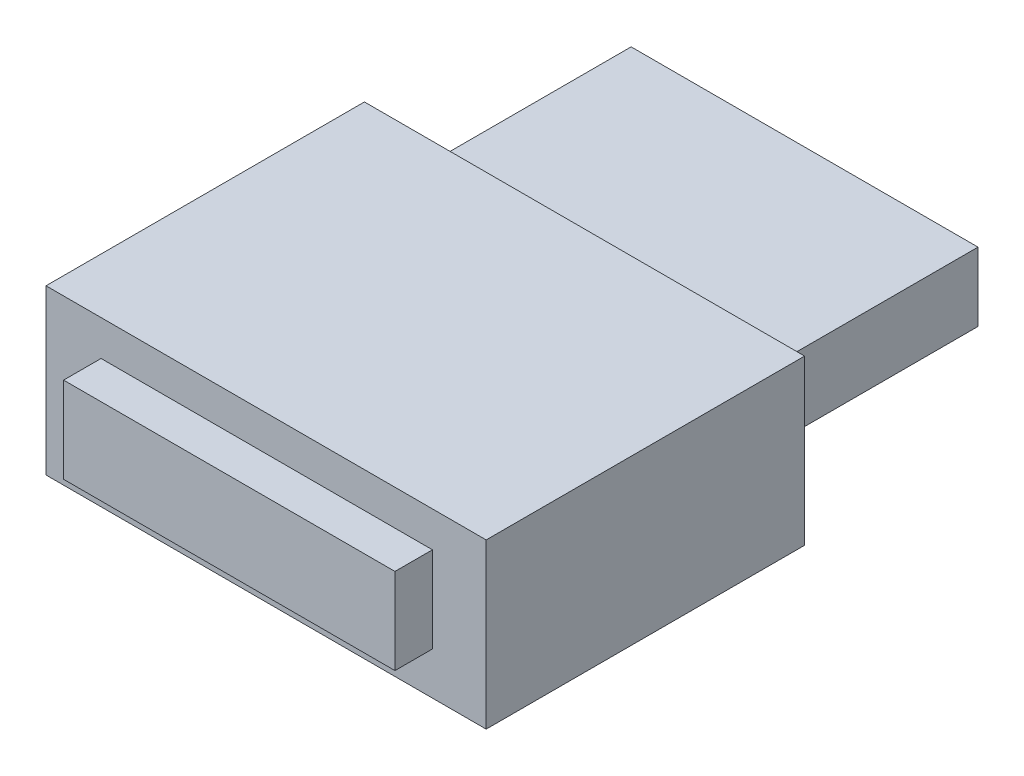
ISO-10303-21;
HEADER;
FILE_DESCRIPTION(('STEP AP214'),'2;1');
FILE_NAME('part.step','',(''),(''),'','','');
FILE_SCHEMA(('AUTOMOTIVE_DESIGN { 1 0 10303 214 1 1 1 1 }'));
ENDSEC;
DATA;
#1=APPLICATION_CONTEXT('core data for automotive mechanical design processes');
#2=APPLICATION_PROTOCOL_DEFINITION('international standard','automotive_design',2000,#1);
#3=PRODUCT_CONTEXT('',#1,'mechanical');
#4=PRODUCT('Part','Part','',(#3));
#5=PRODUCT_RELATED_PRODUCT_CATEGORY('part','',(#4));
#6=PRODUCT_DEFINITION_FORMATION('','',#4);
#7=PRODUCT_DEFINITION_CONTEXT('part definition',#1,'design');
#8=PRODUCT_DEFINITION('design','',#6,#7);
#9=PRODUCT_DEFINITION_SHAPE('','',#8);
#10=(LENGTH_UNIT() NAMED_UNIT(*) SI_UNIT(.MILLI.,.METRE.));
#11=(NAMED_UNIT(*) PLANE_ANGLE_UNIT() SI_UNIT($,.RADIAN.));
#12=(NAMED_UNIT(*) SI_UNIT($,.STERADIAN.) SOLID_ANGLE_UNIT());
#13=UNCERTAINTY_MEASURE_WITH_UNIT(LENGTH_MEASURE(1.E-05),#10,'distance_accuracy_value','');
#14=(GEOMETRIC_REPRESENTATION_CONTEXT(3) GLOBAL_UNCERTAINTY_ASSIGNED_CONTEXT((#13)) GLOBAL_UNIT_ASSIGNED_CONTEXT((#10,
#11,#12)) REPRESENTATION_CONTEXT('',''));
#15=CARTESIAN_POINT('',(0.,0.,0.));
#16=DIRECTION('',(0.,0.,1.));
#17=DIRECTION('',(1.,0.,0.));
#18=AXIS2_PLACEMENT_3D('',#15,#16,#17);
#19=CARTESIAN_POINT('',(-71.6746354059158,35.56,-29.6601759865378));
#20=DIRECTION('',(0.,0.,1.));
#21=DIRECTION('',(1.,0.,0.));
#22=AXIS2_PLACEMENT_3D('',#19,#20,#21);
#23=PLANE('',#22);
#24=DIRECTION('',(-1.,0.,0.));
#25=VECTOR('',#24,1.);
#26=CARTESIAN_POINT('',(-71.6746354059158,0.,-29.6601759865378));
#27=LINE('',#26,#25);
#28=CARTESIAN_POINT('',(23.8293645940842,0.,-29.6601759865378));
#29=VERTEX_POINT('',#28);
#30=CARTESIAN_POINT('',(-71.6746354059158,0.,-29.6601759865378));
#31=VERTEX_POINT('',#30);
#32=EDGE_CURVE('E186',#29,#31,#27,.T.);
#33=ORIENTED_EDGE('',*,*,#32,.T.);
#34=DIRECTION('',(0.,-1.,0.));
#35=VECTOR('',#34,1.);
#36=CARTESIAN_POINT('',(-71.6746354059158,35.56,-29.6601759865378));
#37=LINE('',#36,#35);
#38=CARTESIAN_POINT('',(-71.6746354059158,35.56,-29.6601759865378));
#39=VERTEX_POINT('',#38);
#40=EDGE_CURVE('E192',#39,#31,#37,.T.);
#41=ORIENTED_EDGE('',*,*,#40,.F.);
#42=DIRECTION('',(-1.,0.,0.));
#43=VECTOR('',#42,1.);
#44=CARTESIAN_POINT('',(-71.6746354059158,35.56,-29.6601759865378));
#45=LINE('',#44,#43);
#46=CARTESIAN_POINT('',(23.8293645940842,35.56,-29.6601759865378));
#47=VERTEX_POINT('',#46);
#48=EDGE_CURVE('E190',#47,#39,#45,.T.);
#49=ORIENTED_EDGE('',*,*,#48,.F.);
#50=DIRECTION('',(0.,-1.,0.));
#51=VECTOR('',#50,1.);
#52=CARTESIAN_POINT('',(23.8293645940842,35.56,-29.6601759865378));
#53=LINE('',#52,#51);
#54=EDGE_CURVE('E202',#47,#29,#53,.T.);
#55=ORIENTED_EDGE('',*,*,#54,.T.);
#56=EDGE_LOOP('',(#33,#41,#49,#55));
#57=FACE_BOUND('',#56,.T.);
#58=DIRECTION('',(0.,1.,0.));
#59=VECTOR('',#58,1.);
#60=CARTESIAN_POINT('',(-64.6080360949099,24.0443151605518,-29.6601759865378));
#61=LINE('',#60,#59);
#62=CARTESIAN_POINT('',(-64.6080360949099,9.13252595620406,-29.6601759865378));
#63=VERTEX_POINT('',#62);
#64=CARTESIAN_POINT('',(-64.6080360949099,24.0443151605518,-29.6601759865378));
#65=VERTEX_POINT('',#64);
#66=EDGE_CURVE('E142',#63,#65,#61,.T.);
#67=ORIENTED_EDGE('',*,*,#66,.F.);
#68=DIRECTION('',(-1.,0.,0.));
#69=VECTOR('',#68,1.);
#70=CARTESIAN_POINT('',(-64.6080360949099,9.13252595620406,-29.6601759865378));
#71=LINE('',#70,#69);
#72=CARTESIAN_POINT('',(10.6523337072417,9.13252595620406,-29.6601759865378));
#73=VERTEX_POINT('',#72);
#74=EDGE_CURVE('E139',#73,#63,#71,.T.);
#75=ORIENTED_EDGE('',*,*,#74,.F.);
#76=DIRECTION('',(0.,-1.,0.));
#77=VECTOR('',#76,1.);
#78=CARTESIAN_POINT('',(10.6523337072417,24.0443151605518,-29.6601759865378));
#79=LINE('',#78,#77);
#80=CARTESIAN_POINT('',(10.6523337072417,24.0443151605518,-29.6601759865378));
#81=VERTEX_POINT('',#80);
#82=EDGE_CURVE('E53',#81,#73,#79,.T.);
#83=ORIENTED_EDGE('',*,*,#82,.F.);
#84=DIRECTION('',(1.,0.,0.));
#85=VECTOR('',#84,1.);
#86=CARTESIAN_POINT('',(-64.6080360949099,24.0443151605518,-29.6601759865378));
#87=LINE('',#86,#85);
#88=EDGE_CURVE('E48',#65,#81,#87,.T.);
#89=ORIENTED_EDGE('',*,*,#88,.F.);
#90=EDGE_LOOP('',(#67,#75,#83,#89));
#91=FACE_BOUND('',#90,.T.);
#92=ADVANCED_FACE('F33',(#57,#91),#23,.F.);
#93=CARTESIAN_POINT('',(-71.6746354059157,35.56,39.4278240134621));
#94=DIRECTION('',(0.,0.,-1.));
#95=DIRECTION('',(-1.,0.,0.));
#96=AXIS2_PLACEMENT_3D('',#93,#94,#95);
#97=PLANE('',#96);
#98=DIRECTION('',(1.,0.,0.));
#99=VECTOR('',#98,1.);
#100=CARTESIAN_POINT('',(-71.6746354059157,0.,39.4278240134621));
#101=LINE('',#100,#99);
#102=CARTESIAN_POINT('',(-71.6746354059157,0.,39.4278240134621));
#103=VERTEX_POINT('',#102);
#104=CARTESIAN_POINT('',(23.8293645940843,0.,39.4278240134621));
#105=VERTEX_POINT('',#104);
#106=EDGE_CURVE('E195',#103,#105,#101,.T.);
#107=ORIENTED_EDGE('',*,*,#106,.T.);
#108=DIRECTION('',(0.,-1.,0.));
#109=VECTOR('',#108,1.);
#110=CARTESIAN_POINT('',(23.8293645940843,35.56,39.4278240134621));
#111=LINE('',#110,#109);
#112=CARTESIAN_POINT('',(23.8293645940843,35.56,39.4278240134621));
#113=VERTEX_POINT('',#112);
#114=EDGE_CURVE('E41',#113,#105,#111,.T.);
#115=ORIENTED_EDGE('',*,*,#114,.F.);
#116=DIRECTION('',(1.,0.,0.));
#117=VECTOR('',#116,1.);
#118=CARTESIAN_POINT('',(-71.6746354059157,35.56,39.4278240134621));
#119=LINE('',#118,#117);
#120=CARTESIAN_POINT('',(-71.6746354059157,35.56,39.4278240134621));
#121=VERTEX_POINT('',#120);
#122=EDGE_CURVE('E185',#121,#113,#119,.T.);
#123=ORIENTED_EDGE('',*,*,#122,.F.);
#124=DIRECTION('',(0.,-1.,0.));
#125=VECTOR('',#124,1.);
#126=CARTESIAN_POINT('',(-71.6746354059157,35.56,39.4278240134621));
#127=LINE('',#126,#125);
#128=EDGE_CURVE('E11',#121,#103,#127,.T.);
#129=ORIENTED_EDGE('',*,*,#128,.T.);
#130=EDGE_LOOP('',(#107,#115,#123,#129));
#131=FACE_BOUND('',#130,.T.);
#132=DIRECTION('',(0.,-1.,0.));
#133=VECTOR('',#132,1.);
#134=CARTESIAN_POINT('',(-59.729239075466,27.8715948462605,39.4278240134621));
#135=LINE('',#134,#133);
#136=CARTESIAN_POINT('',(-59.729239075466,27.8715948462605,39.4278240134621));
#137=VERTEX_POINT('',#136);
#138=CARTESIAN_POINT('',(-59.729239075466,9.23378191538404,39.4278240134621));
#139=VERTEX_POINT('',#138);
#140=EDGE_CURVE('E143',#137,#139,#135,.T.);
#141=ORIENTED_EDGE('',*,*,#140,.F.);
#142=DIRECTION('',(-1.,0.,0.));
#143=VECTOR('',#142,1.);
#144=CARTESIAN_POINT('',(-59.729239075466,27.8715948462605,39.4278240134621));
#145=LINE('',#144,#143);
#146=CARTESIAN_POINT('',(12.1661008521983,27.8715948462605,39.4278240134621));
#147=VERTEX_POINT('',#146);
#148=EDGE_CURVE('E156',#147,#137,#145,.T.);
#149=ORIENTED_EDGE('',*,*,#148,.F.);
#150=DIRECTION('',(0.,1.,0.));
#151=VECTOR('',#150,1.);
#152=CARTESIAN_POINT('',(12.1661008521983,27.8715948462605,39.4278240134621));
#153=LINE('',#152,#151);
#154=CARTESIAN_POINT('',(12.1661008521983,9.23378191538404,39.4278240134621));
#155=VERTEX_POINT('',#154);
#156=EDGE_CURVE('E165',#155,#147,#153,.T.);
#157=ORIENTED_EDGE('',*,*,#156,.F.);
#158=DIRECTION('',(1.,0.,0.));
#159=VECTOR('',#158,1.);
#160=CARTESIAN_POINT('',(-59.729239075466,9.23378191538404,39.4278240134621));
#161=LINE('',#160,#159);
#162=EDGE_CURVE('E146',#139,#155,#161,.T.);
#163=ORIENTED_EDGE('',*,*,#162,.F.);
#164=EDGE_LOOP('',(#141,#149,#157,#163));
#165=FACE_BOUND('',#164,.T.);
#166=ADVANCED_FACE('F224',(#131,#165),#97,.F.);
#167=CARTESIAN_POINT('',(-71.6746354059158,35.56,-29.6601759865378));
#168=DIRECTION('',(1.,0.,0.));
#169=DIRECTION('',(0.,0.,-1.));
#170=AXIS2_PLACEMENT_3D('',#167,#168,#169);
#171=PLANE('',#170);
#172=DIRECTION('',(0.,0.,1.));
#173=VECTOR('',#172,1.);
#174=CARTESIAN_POINT('',(-71.6746354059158,0.,-29.6601759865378));
#175=LINE('',#174,#173);
#176=EDGE_CURVE('E181',#31,#103,#175,.T.);
#177=ORIENTED_EDGE('',*,*,#176,.T.);
#178=ORIENTED_EDGE('',*,*,#128,.F.);
#179=DIRECTION('',(0.,0.,1.));
#180=VECTOR('',#179,1.);
#181=CARTESIAN_POINT('',(-71.6746354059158,35.56,-29.6601759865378));
#182=LINE('',#181,#180);
#183=EDGE_CURVE('E182',#39,#121,#182,.T.);
#184=ORIENTED_EDGE('',*,*,#183,.F.);
#185=ORIENTED_EDGE('',*,*,#40,.T.);
#186=EDGE_LOOP('',(#177,#178,#184,#185));
#187=FACE_BOUND('',#186,.T.);
#188=ADVANCED_FACE('F35',(#187),#171,.F.);
#189=CARTESIAN_POINT('',(23.8293645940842,35.56,-29.6601759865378));
#190=DIRECTION('',(-1.,0.,0.));
#191=DIRECTION('',(0.,0.,1.));
#192=AXIS2_PLACEMENT_3D('',#189,#190,#191);
#193=PLANE('',#192);
#194=DIRECTION('',(0.,0.,-1.));
#195=VECTOR('',#194,1.);
#196=CARTESIAN_POINT('',(23.8293645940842,0.,-29.6601759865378));
#197=LINE('',#196,#195);
#198=EDGE_CURVE('E197',#105,#29,#197,.T.);
#199=ORIENTED_EDGE('',*,*,#198,.T.);
#200=ORIENTED_EDGE('',*,*,#54,.F.);
#201=DIRECTION('',(0.,0.,-1.));
#202=VECTOR('',#201,1.);
#203=CARTESIAN_POINT('',(23.8293645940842,35.56,-29.6601759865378));
#204=LINE('',#203,#202);
#205=EDGE_CURVE('E188',#113,#47,#204,.T.);
#206=ORIENTED_EDGE('',*,*,#205,.F.);
#207=ORIENTED_EDGE('',*,*,#114,.T.);
#208=EDGE_LOOP('',(#199,#200,#206,#207));
#209=FACE_BOUND('',#208,.T.);
#210=ADVANCED_FACE('F209',(#209),#193,.F.);
#211=CARTESIAN_POINT('',(-71.6746354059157,35.56,39.4278240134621));
#212=DIRECTION('',(0.,1.,0.));
#213=DIRECTION('',(0.,0.,1.));
#214=AXIS2_PLACEMENT_3D('',#211,#212,#213);
#215=PLANE('',#214);
#216=ORIENTED_EDGE('',*,*,#183,.T.);
#217=ORIENTED_EDGE('',*,*,#122,.T.);
#218=ORIENTED_EDGE('',*,*,#205,.T.);
#219=ORIENTED_EDGE('',*,*,#48,.T.);
#220=EDGE_LOOP('',(#216,#217,#218,#219));
#221=FACE_BOUND('',#220,.T.);
#222=ADVANCED_FACE('F223',(#221),#215,.T.);
#223=CARTESIAN_POINT('',(-71.6746354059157,0.,39.4278240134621));
#224=DIRECTION('',(0.,1.,0.));
#225=DIRECTION('',(0.,0.,1.));
#226=AXIS2_PLACEMENT_3D('',#223,#224,#225);
#227=PLANE('',#226);
#228=ORIENTED_EDGE('',*,*,#176,.F.);
#229=ORIENTED_EDGE('',*,*,#32,.F.);
#230=ORIENTED_EDGE('',*,*,#198,.F.);
#231=ORIENTED_EDGE('',*,*,#106,.F.);
#232=EDGE_LOOP('',(#228,#229,#230,#231));
#233=FACE_BOUND('',#232,.T.);
#234=ADVANCED_FACE('F215',(#233),#227,.F.);
#235=CARTESIAN_POINT('',(-59.729239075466,27.8715948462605,47.5558240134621));
#236=DIRECTION('',(1.,0.,0.));
#237=DIRECTION('',(0.,0.,-1.));
#238=AXIS2_PLACEMENT_3D('',#235,#236,#237);
#239=PLANE('',#238);
#240=ORIENTED_EDGE('',*,*,#140,.T.);
#241=DIRECTION('',(0.,0.,-1.));
#242=VECTOR('',#241,1.);
#243=CARTESIAN_POINT('',(-59.729239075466,9.23378191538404,47.5558240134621));
#244=LINE('',#243,#242);
#245=CARTESIAN_POINT('',(-59.729239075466,9.23378191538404,47.5558240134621));
#246=VERTEX_POINT('',#245);
#247=EDGE_CURVE('E178',#246,#139,#244,.T.);
#248=ORIENTED_EDGE('',*,*,#247,.F.);
#249=DIRECTION('',(0.,-1.,0.));
#250=VECTOR('',#249,1.);
#251=CARTESIAN_POINT('',(-59.729239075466,27.8715948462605,47.5558240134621));
#252=LINE('',#251,#250);
#253=CARTESIAN_POINT('',(-59.729239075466,27.8715948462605,47.5558240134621));
#254=VERTEX_POINT('',#253);
#255=EDGE_CURVE('E152',#254,#246,#252,.T.);
#256=ORIENTED_EDGE('',*,*,#255,.F.);
#257=DIRECTION('',(0.,0.,-1.));
#258=VECTOR('',#257,1.);
#259=CARTESIAN_POINT('',(-59.729239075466,27.8715948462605,47.5558240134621));
#260=LINE('',#259,#258);
#261=EDGE_CURVE('E161',#254,#137,#260,.T.);
#262=ORIENTED_EDGE('',*,*,#261,.T.);
#263=EDGE_LOOP('',(#240,#248,#256,#262));
#264=FACE_BOUND('',#263,.T.);
#265=ADVANCED_FACE('F235',(#264),#239,.F.);
#266=CARTESIAN_POINT('',(-59.729239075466,9.23378191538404,47.5558240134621));
#267=DIRECTION('',(0.,1.,0.));
#268=DIRECTION('',(0.,0.,1.));
#269=AXIS2_PLACEMENT_3D('',#266,#267,#268);
#270=PLANE('',#269);
#271=ORIENTED_EDGE('',*,*,#162,.T.);
#272=DIRECTION('',(0.,0.,-1.));
#273=VECTOR('',#272,1.);
#274=CARTESIAN_POINT('',(12.1661008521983,9.23378191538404,47.5558240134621));
#275=LINE('',#274,#273);
#276=CARTESIAN_POINT('',(12.1661008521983,9.23378191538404,47.5558240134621));
#277=VERTEX_POINT('',#276);
#278=EDGE_CURVE('E175',#277,#155,#275,.T.);
#279=ORIENTED_EDGE('',*,*,#278,.F.);
#280=DIRECTION('',(1.,0.,0.));
#281=VECTOR('',#280,1.);
#282=CARTESIAN_POINT('',(-59.729239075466,9.23378191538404,47.5558240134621));
#283=LINE('',#282,#281);
#284=EDGE_CURVE('E155',#246,#277,#283,.T.);
#285=ORIENTED_EDGE('',*,*,#284,.F.);
#286=ORIENTED_EDGE('',*,*,#247,.T.);
#287=EDGE_LOOP('',(#271,#279,#285,#286));
#288=FACE_BOUND('',#287,.T.);
#289=ADVANCED_FACE('F243',(#288),#270,.F.);
#290=CARTESIAN_POINT('',(12.1661008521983,27.8715948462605,47.5558240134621));
#291=DIRECTION('',(-1.,0.,0.));
#292=DIRECTION('',(0.,0.,1.));
#293=AXIS2_PLACEMENT_3D('',#290,#291,#292);
#294=PLANE('',#293);
#295=ORIENTED_EDGE('',*,*,#156,.T.);
#296=DIRECTION('',(0.,0.,-1.));
#297=VECTOR('',#296,1.);
#298=CARTESIAN_POINT('',(12.1661008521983,27.8715948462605,47.5558240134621));
#299=LINE('',#298,#297);
#300=CARTESIAN_POINT('',(12.1661008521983,27.8715948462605,47.5558240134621));
#301=VERTEX_POINT('',#300);
#302=EDGE_CURVE('E172',#301,#147,#299,.T.);
#303=ORIENTED_EDGE('',*,*,#302,.F.);
#304=DIRECTION('',(0.,1.,0.));
#305=VECTOR('',#304,1.);
#306=CARTESIAN_POINT('',(12.1661008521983,27.8715948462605,47.5558240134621));
#307=LINE('',#306,#305);
#308=EDGE_CURVE('E158',#277,#301,#307,.T.);
#309=ORIENTED_EDGE('',*,*,#308,.F.);
#310=ORIENTED_EDGE('',*,*,#278,.T.);
#311=EDGE_LOOP('',(#295,#303,#309,#310));
#312=FACE_BOUND('',#311,.T.);
#313=ADVANCED_FACE('F241',(#312),#294,.F.);
#314=CARTESIAN_POINT('',(-59.729239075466,27.8715948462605,47.5558240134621));
#315=DIRECTION('',(0.,-1.,0.));
#316=DIRECTION('',(0.,0.,-1.));
#317=AXIS2_PLACEMENT_3D('',#314,#315,#316);
#318=PLANE('',#317);
#319=ORIENTED_EDGE('',*,*,#148,.T.);
#320=ORIENTED_EDGE('',*,*,#261,.F.);
#321=DIRECTION('',(-1.,0.,0.));
#322=VECTOR('',#321,1.);
#323=CARTESIAN_POINT('',(-59.729239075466,27.8715948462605,47.5558240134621));
#324=LINE('',#323,#322);
#325=EDGE_CURVE('E160',#301,#254,#324,.T.);
#326=ORIENTED_EDGE('',*,*,#325,.F.);
#327=ORIENTED_EDGE('',*,*,#302,.T.);
#328=EDGE_LOOP('',(#319,#320,#326,#327));
#329=FACE_BOUND('',#328,.T.);
#330=ADVANCED_FACE('F231',(#329),#318,.F.);
#331=CARTESIAN_POINT('',(-59.729239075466,9.23378191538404,47.5558240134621));
#332=DIRECTION('',(0.,0.,1.));
#333=DIRECTION('',(1.,0.,0.));
#334=AXIS2_PLACEMENT_3D('',#331,#332,#333);
#335=PLANE('',#334);
#336=ORIENTED_EDGE('',*,*,#255,.T.);
#337=ORIENTED_EDGE('',*,*,#284,.T.);
#338=ORIENTED_EDGE('',*,*,#308,.T.);
#339=ORIENTED_EDGE('',*,*,#325,.T.);
#340=EDGE_LOOP('',(#336,#337,#338,#339));
#341=FACE_BOUND('',#340,.T.);
#342=ADVANCED_FACE('F237',(#341),#335,.T.);
#343=CARTESIAN_POINT('',(-64.6080360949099,24.0443151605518,-80.4601759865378));
#344=DIRECTION('',(1.,0.,0.));
#345=DIRECTION('',(0.,0.,-1.));
#346=AXIS2_PLACEMENT_3D('',#343,#344,#345);
#347=PLANE('',#346);
#348=ORIENTED_EDGE('',*,*,#66,.T.);
#349=DIRECTION('',(0.,0.,1.));
#350=VECTOR('',#349,1.);
#351=CARTESIAN_POINT('',(-64.6080360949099,24.0443151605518,-80.4601759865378));
#352=LINE('',#351,#350);
#353=CARTESIAN_POINT('',(-64.6080360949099,24.0443151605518,-80.4601759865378));
#354=VERTEX_POINT('',#353);
#355=EDGE_CURVE('E123',#354,#65,#352,.T.);
#356=ORIENTED_EDGE('',*,*,#355,.F.);
#357=DIRECTION('',(0.,1.,0.));
#358=VECTOR('',#357,1.);
#359=CARTESIAN_POINT('',(-64.6080360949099,24.0443151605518,-80.4601759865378));
#360=LINE('',#359,#358);
#361=CARTESIAN_POINT('',(-64.6080360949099,9.13252595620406,-80.4601759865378));
#362=VERTEX_POINT('',#361);
#363=EDGE_CURVE('E130',#362,#354,#360,.T.);
#364=ORIENTED_EDGE('',*,*,#363,.F.);
#365=DIRECTION('',(0.,0.,1.));
#366=VECTOR('',#365,1.);
#367=CARTESIAN_POINT('',(-64.6080360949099,9.13252595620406,-80.4601759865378));
#368=LINE('',#367,#366);
#369=EDGE_CURVE('E361',#362,#63,#368,.T.);
#370=ORIENTED_EDGE('',*,*,#369,.T.);
#371=EDGE_LOOP('',(#348,#356,#364,#370));
#372=FACE_BOUND('',#371,.T.);
#373=ADVANCED_FACE('F141',(#372),#347,.F.);
#374=CARTESIAN_POINT('',(-64.6080360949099,24.0443151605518,-80.4601759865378));
#375=DIRECTION('',(0.,-1.,0.));
#376=DIRECTION('',(0.,0.,-1.));
#377=AXIS2_PLACEMENT_3D('',#374,#375,#376);
#378=PLANE('',#377);
#379=ORIENTED_EDGE('',*,*,#88,.T.);
#380=DIRECTION('',(0.,0.,1.));
#381=VECTOR('',#380,1.);
#382=CARTESIAN_POINT('',(10.6523337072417,24.0443151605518,-80.4601759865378));
#383=LINE('',#382,#381);
#384=CARTESIAN_POINT('',(10.6523337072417,24.0443151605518,-80.4601759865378));
#385=VERTEX_POINT('',#384);
#386=EDGE_CURVE('E126',#385,#81,#383,.T.);
#387=ORIENTED_EDGE('',*,*,#386,.F.);
#388=DIRECTION('',(1.,0.,0.));
#389=VECTOR('',#388,1.);
#390=CARTESIAN_POINT('',(-64.6080360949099,24.0443151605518,-80.4601759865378));
#391=LINE('',#390,#389);
#392=EDGE_CURVE('E119',#354,#385,#391,.T.);
#393=ORIENTED_EDGE('',*,*,#392,.F.);
#394=ORIENTED_EDGE('',*,*,#355,.T.);
#395=EDGE_LOOP('',(#379,#387,#393,#394));
#396=FACE_BOUND('',#395,.T.);
#397=ADVANCED_FACE('F121',(#396),#378,.F.);
#398=CARTESIAN_POINT('',(10.6523337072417,24.0443151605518,-80.4601759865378));
#399=DIRECTION('',(-1.,0.,0.));
#400=DIRECTION('',(0.,0.,1.));
#401=AXIS2_PLACEMENT_3D('',#398,#399,#400);
#402=PLANE('',#401);
#403=ORIENTED_EDGE('',*,*,#82,.T.);
#404=DIRECTION('',(0.,0.,1.));
#405=VECTOR('',#404,1.);
#406=CARTESIAN_POINT('',(10.6523337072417,9.13252595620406,-80.4601759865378));
#407=LINE('',#406,#405);
#408=CARTESIAN_POINT('',(10.6523337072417,9.13252595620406,-80.4601759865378));
#409=VERTEX_POINT('',#408);
#410=EDGE_CURVE('E148',#409,#73,#407,.T.);
#411=ORIENTED_EDGE('',*,*,#410,.F.);
#412=DIRECTION('',(0.,-1.,0.));
#413=VECTOR('',#412,1.);
#414=CARTESIAN_POINT('',(10.6523337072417,24.0443151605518,-80.4601759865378));
#415=LINE('',#414,#413);
#416=EDGE_CURVE('E129',#385,#409,#415,.T.);
#417=ORIENTED_EDGE('',*,*,#416,.F.);
#418=ORIENTED_EDGE('',*,*,#386,.T.);
#419=EDGE_LOOP('',(#403,#411,#417,#418));
#420=FACE_BOUND('',#419,.T.);
#421=ADVANCED_FACE('F328',(#420),#402,.F.);
#422=CARTESIAN_POINT('',(-64.6080360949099,9.13252595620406,-80.4601759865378));
#423=DIRECTION('',(0.,1.,0.));
#424=DIRECTION('',(0.,0.,1.));
#425=AXIS2_PLACEMENT_3D('',#422,#423,#424);
#426=PLANE('',#425);
#427=ORIENTED_EDGE('',*,*,#74,.T.);
#428=ORIENTED_EDGE('',*,*,#369,.F.);
#429=DIRECTION('',(-1.,0.,0.));
#430=VECTOR('',#429,1.);
#431=CARTESIAN_POINT('',(-64.6080360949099,9.13252595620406,-80.4601759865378));
#432=LINE('',#431,#430);
#433=EDGE_CURVE('E135',#409,#362,#432,.T.);
#434=ORIENTED_EDGE('',*,*,#433,.F.);
#435=ORIENTED_EDGE('',*,*,#410,.T.);
#436=EDGE_LOOP('',(#427,#428,#434,#435));
#437=FACE_BOUND('',#436,.T.);
#438=ADVANCED_FACE('F337',(#437),#426,.F.);
#439=CARTESIAN_POINT('',(-64.6080360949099,9.13252595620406,-80.4601759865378));
#440=DIRECTION('',(0.,0.,1.));
#441=DIRECTION('',(1.,0.,0.));
#442=AXIS2_PLACEMENT_3D('',#439,#440,#441);
#443=PLANE('',#442);
#444=ORIENTED_EDGE('',*,*,#363,.T.);
#445=ORIENTED_EDGE('',*,*,#392,.T.);
#446=ORIENTED_EDGE('',*,*,#416,.T.);
#447=ORIENTED_EDGE('',*,*,#433,.T.);
#448=EDGE_LOOP('',(#444,#445,#446,#447));
#449=FACE_BOUND('',#448,.T.);
#450=ADVANCED_FACE('F133',(#449),#443,.F.);
#451=CLOSED_SHELL('',(#92,#166,#188,#210,#222,#234,#265,#289,#313,#330,#342,#373,#397,#421,#438,#450));
#452=MANIFOLD_SOLID_BREP('B2',#451);
#453=ADVANCED_BREP_SHAPE_REPRESENTATION('',(#18,#452),#14);
#454=SHAPE_DEFINITION_REPRESENTATION(#9,#453);
ENDSEC;
END-ISO-10303-21;
